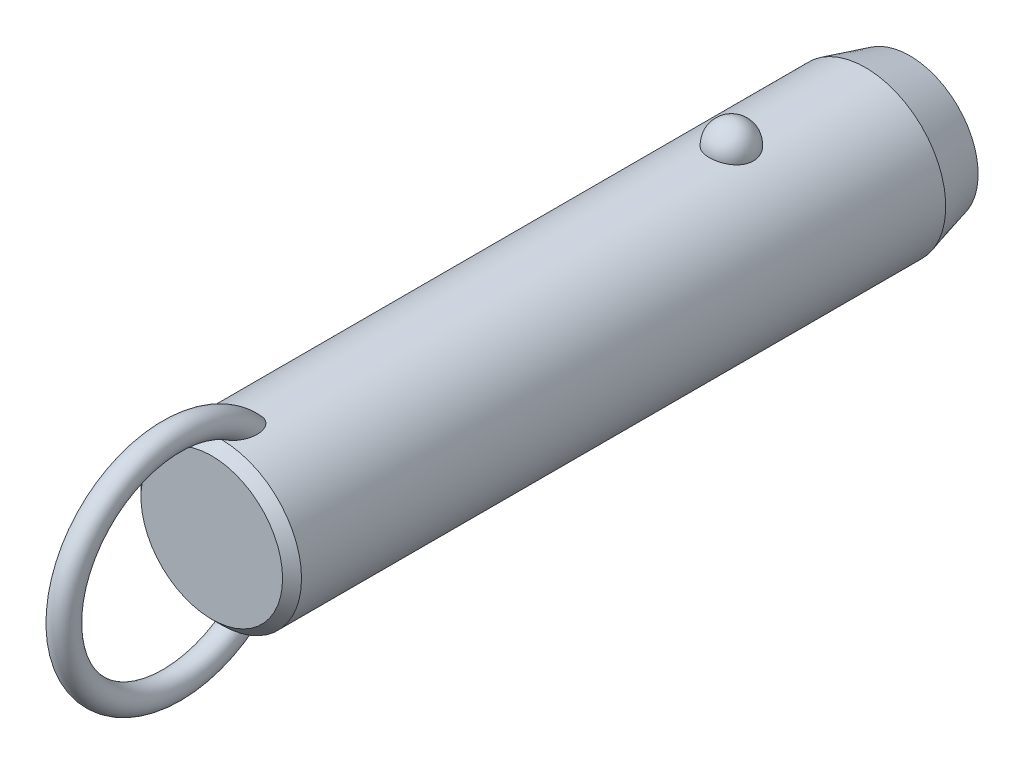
ISO-10303-21;
HEADER;
FILE_DESCRIPTION(('STEP AP214'),'2;1');
FILE_NAME('part.step','',(''),(''),'','','');
FILE_SCHEMA(('AUTOMOTIVE_DESIGN { 1 0 10303 214 1 1 1 1 }'));
ENDSEC;
DATA;
#1=APPLICATION_CONTEXT('core data for automotive mechanical design processes');
#2=APPLICATION_PROTOCOL_DEFINITION('international standard','automotive_design',2000,#1);
#3=PRODUCT_CONTEXT('',#1,'mechanical');
#4=PRODUCT('Part','Part','',(#3));
#5=PRODUCT_RELATED_PRODUCT_CATEGORY('part','',(#4));
#6=PRODUCT_DEFINITION_FORMATION('','',#4);
#7=PRODUCT_DEFINITION_CONTEXT('part definition',#1,'design');
#8=PRODUCT_DEFINITION('design','',#6,#7);
#9=PRODUCT_DEFINITION_SHAPE('','',#8);
#10=(LENGTH_UNIT() NAMED_UNIT(*) SI_UNIT(.MILLI.,.METRE.));
#11=(NAMED_UNIT(*) PLANE_ANGLE_UNIT() SI_UNIT($,.RADIAN.));
#12=(NAMED_UNIT(*) SI_UNIT($,.STERADIAN.) SOLID_ANGLE_UNIT());
#13=UNCERTAINTY_MEASURE_WITH_UNIT(LENGTH_MEASURE(1.E-05),#10,'distance_accuracy_value','');
#14=(GEOMETRIC_REPRESENTATION_CONTEXT(3) GLOBAL_UNCERTAINTY_ASSIGNED_CONTEXT((#13)) GLOBAL_UNIT_ASSIGNED_CONTEXT((#10,
#11,#12)) REPRESENTATION_CONTEXT('',''));
#15=CARTESIAN_POINT('',(0.,0.,0.));
#16=DIRECTION('',(0.,0.,1.));
#17=DIRECTION('',(1.,0.,0.));
#18=AXIS2_PLACEMENT_3D('',#15,#16,#17);
#19=CARTESIAN_POINT('',(0.,0.,66.));
#20=DIRECTION('',(0.,0.,-1.));
#21=DIRECTION('',(-1.,0.,0.));
#22=AXIS2_PLACEMENT_3D('',#19,#20,#21);
#23=CYLINDRICAL_SURFACE('',#22,12.7);
#24=CARTESIAN_POINT('',(3.46661256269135,12.2177165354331,-3.5));
#25=CARTESIAN_POINT('',(3.4666090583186,12.2177194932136,-3.30432790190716));
#26=CARTESIAN_POINT('',(3.45063567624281,12.2222841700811,-3.10861112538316));
#27=CARTESIAN_POINT('',(3.38712451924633,12.2400345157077,-2.72271899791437));
#28=CARTESIAN_POINT('',(3.33957415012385,12.2532236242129,-2.53254588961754));
#29=CARTESIAN_POINT('',(3.2141234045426,12.286724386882,-2.16324948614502));
#30=CARTESIAN_POINT('',(3.13623639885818,12.3070329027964,-1.98412136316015));
#31=CARTESIAN_POINT('',(2.95205930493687,12.3525018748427,-1.64180592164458));
#32=CARTESIAN_POINT('',(2.84577003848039,12.3776621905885,-1.47861814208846));
#33=CARTESIAN_POINT('',(2.60688050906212,12.4301712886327,-1.17190583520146));
#34=CARTESIAN_POINT('',(2.47415697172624,12.4575299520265,-1.02847897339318));
#35=CARTESIAN_POINT('',(2.18615174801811,12.5112810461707,-0.766177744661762));
#36=CARTESIAN_POINT('',(2.03087002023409,12.5376734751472,-0.64730342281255));
#37=CARTESIAN_POINT('',(1.70237334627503,12.5864761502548,-0.437732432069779));
#38=CARTESIAN_POINT('',(1.52920948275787,12.6088972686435,-0.346958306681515));
#39=CARTESIAN_POINT('',(1.16944170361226,12.6473352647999,-0.195750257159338));
#40=CARTESIAN_POINT('',(0.982839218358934,12.663352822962,-0.135313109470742));
#41=CARTESIAN_POINT('',(0.604961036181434,12.6869706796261,-0.0473241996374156));
#42=CARTESIAN_POINT('',(0.41382314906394,12.6947125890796,-0.0192185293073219));
#43=CARTESIAN_POINT('',(0.0293827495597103,12.7014203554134,0.0051725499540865));
#44=CARTESIAN_POINT('',(-0.163919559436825,12.7003870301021,0.00146092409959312));
#45=CARTESIAN_POINT('',(-0.544374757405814,12.689735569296,-0.0373939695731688));
#46=CARTESIAN_POINT('',(-0.731575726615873,12.6802364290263,-0.0721015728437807));
#47=CARTESIAN_POINT('',(-1.09733277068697,12.6538333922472,-0.171364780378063));
#48=CARTESIAN_POINT('',(-1.27588869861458,12.6369293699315,-0.235920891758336));
#49=CARTESIAN_POINT('',(-1.6204698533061,12.5973946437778,-0.393548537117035));
#50=CARTESIAN_POINT('',(-1.78641865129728,12.5747321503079,-0.486778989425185));
#51=CARTESIAN_POINT('',(-2.10030671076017,12.5261316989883,-0.699110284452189));
#52=CARTESIAN_POINT('',(-2.24824419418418,12.5001934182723,-0.818213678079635));
#53=CARTESIAN_POINT('',(-2.52491489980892,12.4472906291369,-1.08157124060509));
#54=CARTESIAN_POINT('',(-2.65324222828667,12.4203160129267,-1.22624992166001));
#55=CARTESIAN_POINT('',(-2.88410007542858,12.3687509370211,-1.53528325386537));
#56=CARTESIAN_POINT('',(-2.98662883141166,12.3441606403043,-1.69963924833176));
#57=CARTESIAN_POINT('',(-3.16432417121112,12.2998199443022,-2.04548497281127));
#58=CARTESIAN_POINT('',(-3.23917525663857,12.2801261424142,-2.22714424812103));
#59=CARTESIAN_POINT('',(-3.35800573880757,12.248167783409,-2.6009138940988));
#60=CARTESIAN_POINT('',(-3.4019860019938,12.2359030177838,-2.79302397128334));
#61=CARTESIAN_POINT('',(-3.45784812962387,12.2202347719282,-3.18140279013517));
#62=CARTESIAN_POINT('',(-3.46986123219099,12.2167950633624,-3.37765118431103));
#63=CARTESIAN_POINT('',(-3.46186273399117,12.2190638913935,-3.76943689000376));
#64=CARTESIAN_POINT('',(-3.44185196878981,12.2247721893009,-3.96497421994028));
#65=CARTESIAN_POINT('',(-3.37048652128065,12.2446381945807,-4.34881728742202));
#66=CARTESIAN_POINT('',(-3.31928253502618,12.2587552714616,-4.53715319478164));
#67=CARTESIAN_POINT('',(-3.18693461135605,12.2938237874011,-4.90231727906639));
#68=CARTESIAN_POINT('',(-3.1057895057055,12.3147754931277,-5.07914500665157));
#69=CARTESIAN_POINT('',(-2.91506431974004,12.3613125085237,-5.41732059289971));
#70=CARTESIAN_POINT('',(-2.80533587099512,12.3869217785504,-5.57858147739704));
#71=CARTESIAN_POINT('',(-2.560414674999,12.4398525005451,-5.88013283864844));
#72=CARTESIAN_POINT('',(-2.42522099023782,12.4671740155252,-6.02042254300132));
#73=CARTESIAN_POINT('',(-2.1323357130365,12.5205965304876,-6.27662798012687));
#74=CARTESIAN_POINT('',(-1.97456596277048,12.5466928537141,-6.3924554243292));
#75=CARTESIAN_POINT('',(-1.64115839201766,12.5946384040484,-6.59583547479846));
#76=CARTESIAN_POINT('',(-1.46552179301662,12.6164879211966,-6.68339001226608));
#77=CARTESIAN_POINT('',(-1.10356050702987,12.6532533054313,-6.82682153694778));
#78=CARTESIAN_POINT('',(-0.9173913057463,12.6682500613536,-6.8830698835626));
#79=CARTESIAN_POINT('',(-0.537836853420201,12.6900288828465,-6.96386887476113));
#80=CARTESIAN_POINT('',(-0.344452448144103,12.6968119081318,-6.9884232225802));
#81=CARTESIAN_POINT('',(0.0402577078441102,12.7013667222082,-7.00496469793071));
#82=CARTESIAN_POINT('',(0.231556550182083,12.6993008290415,-6.99753844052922));
#83=CARTESIAN_POINT('',(0.610105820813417,12.6867505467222,-6.9516636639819));
#84=CARTESIAN_POINT('',(0.797356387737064,12.6762664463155,-6.913216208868));
#85=CARTESIAN_POINT('',(1.16186657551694,12.6480587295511,-6.80658431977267));
#86=CARTESIAN_POINT('',(1.33915951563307,12.6303611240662,-6.73850666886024));
#87=CARTESIAN_POINT('',(1.67968518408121,12.5896027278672,-6.5745087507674));
#88=CARTESIAN_POINT('',(1.84291705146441,12.5665416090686,-6.47858678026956));
#89=CARTESIAN_POINT('',(2.15340192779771,12.5171072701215,-6.25982455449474));
#90=CARTESIAN_POINT('',(2.30037831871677,12.4906895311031,-6.13660186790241));
#91=CARTESIAN_POINT('',(2.5717412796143,12.4376567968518,-5.86739587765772));
#92=CARTESIAN_POINT('',(2.69612388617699,12.4110417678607,-5.72140858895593));
#93=CARTESIAN_POINT('',(2.92107785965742,12.360051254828,-5.40794137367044));
#94=CARTESIAN_POINT('',(3.02121329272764,12.3357209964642,-5.24014110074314));
#95=CARTESIAN_POINT('',(3.19236291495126,12.2925446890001,-4.88969865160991));
#96=CARTESIAN_POINT('',(3.26338839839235,12.2736965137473,-4.70706226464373));
#97=CARTESIAN_POINT('',(3.36788038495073,12.245404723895,-4.35469510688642));
#98=CARTESIAN_POINT('',(3.40484026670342,12.2351018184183,-4.18605935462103));
#99=CARTESIAN_POINT('',(3.45420764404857,12.2212564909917,-3.84496058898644));
#100=CARTESIAN_POINT('',(3.46661565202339,12.2177139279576,-3.67249765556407));
#101=CARTESIAN_POINT('',(3.46661256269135,12.2177165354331,-3.5));
#102=B_SPLINE_CURVE_WITH_KNOTS('',3,(#24,#25,#26,#27,#28,#29,#30,#31,#32,#33,#34,#35,#36,#37,
#38,#39,#40,#41,#42,#43,#44,#45,#46,#47,#48,#49,#50,#51,#52,#53,#54,#55,#56,#57,#58,#59,#60,#61,
#62,#63,#64,#65,#66,#67,#68,#69,#70,#71,#72,#73,#74,#75,#76,#77,#78,#79,#80,#81,#82,#83,#84,#85,
#86,#87,#88,#89,#90,#91,#92,#93,#94,#95,#96,#97,#98,#99,#100,#101),.UNSPECIFIED.,.T.,.F.,(4,2,2,
2,2,2,2,2,2,2,2,2,2,2,2,2,2,2,2,2,2,2,2,2,2,2,2,2,2,2,2,2,2,2,2,2,2,2,4),(0.,0.586396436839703,
1.17302689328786,1.7593990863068,2.34575431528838,2.93491084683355,3.52406845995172,
4.11158733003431,4.69904375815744,5.2762784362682,5.85345931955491,6.42265312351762,
6.99185659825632,7.56427334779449,8.136746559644,8.71981013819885,9.3029135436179,
9.89247258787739,10.4820150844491,11.0691335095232,11.6562366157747,12.2405256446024,
12.8248374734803,13.412244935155,13.9996740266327,14.5891883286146,15.1786623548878,
15.7609861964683,16.3432419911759,16.9148635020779,17.4864654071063,18.0560241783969,
18.6256177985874,19.2037609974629,19.7820055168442,20.3699810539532,20.957728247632,
21.4746855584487,21.9916320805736),.UNSPECIFIED.);
#103=CARTESIAN_POINT('',(3.46661256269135,12.2177165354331,-3.5));
#104=VERTEX_POINT('',#103);
#105=EDGE_CURVE('E41',#104,#104,#102,.T.);
#106=ORIENTED_EDGE('',*,*,#105,.T.);
#107=EDGE_LOOP('',(#106));
#108=FACE_BOUND('',#107,.T.);
#109=CARTESIAN_POINT('',(0.,0.,77.2));
#110=DIRECTION('',(0.,0.,1.));
#111=DIRECTION('',(1.,0.,0.));
#112=AXIS2_PLACEMENT_3D('',#109,#110,#111);
#113=CIRCLE('',#112,12.7);
#114=CARTESIAN_POINT('',(12.7,0.,77.2));
#115=VERTEX_POINT('',#114);
#116=EDGE_CURVE('E10',#115,#115,#113,.F.);
#117=ORIENTED_EDGE('',*,*,#116,.T.);
#118=EDGE_LOOP('',(#117));
#119=FACE_BOUND('',#118,.T.);
#120=CARTESIAN_POINT('',(-0.548122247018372,-12.6881662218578,70.9432187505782));
#121=CARTESIAN_POINT('',(-0.648865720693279,-12.6838128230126,70.977926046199));
#122=CARTESIAN_POINT('',(-0.746398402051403,-12.6783867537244,71.0220428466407));
#123=CARTESIAN_POINT('',(-0.93212506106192,-12.666091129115,71.1267647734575));
#124=CARTESIAN_POINT('',(-1.02030388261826,-12.6592192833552,71.187396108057));
#125=CARTESIAN_POINT('',(-1.18487740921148,-12.6448747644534,71.321847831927));
#126=CARTESIAN_POINT('',(-1.26134296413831,-12.637406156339,71.3955825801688));
#127=CARTESIAN_POINT('',(-1.4023120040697,-12.6225412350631,71.5536045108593));
#128=CARTESIAN_POINT('',(-1.46681470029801,-12.6151449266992,71.6378923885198));
#129=CARTESIAN_POINT('',(-1.60714786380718,-12.5981718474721,71.8496577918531));
#130=CARTESIAN_POINT('',(-1.67725126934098,-12.588900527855,71.980962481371));
#131=CARTESIAN_POINT('',(-1.79536591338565,-12.5725964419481,72.2532471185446));
#132=CARTESIAN_POINT('',(-1.84333535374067,-12.5655679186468,72.3942447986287));
#133=CARTESIAN_POINT('',(-1.93422576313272,-12.5519624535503,72.7376455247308));
#134=CARTESIAN_POINT('',(-1.96788773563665,-12.5466298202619,72.9425578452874));
#135=CARTESIAN_POINT('',(-1.9941399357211,-12.542463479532,73.2517600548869));
#136=CARTESIAN_POINT('',(-1.99883864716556,-12.5417153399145,73.3552987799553));
#137=CARTESIAN_POINT('',(-2.00078003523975,-12.5414074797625,73.5624512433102));
#138=CARTESIAN_POINT('',(-1.99802449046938,-12.5418474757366,73.6660649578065));
#139=CARTESIAN_POINT('',(-1.98336733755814,-12.5441750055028,73.9103207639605));
#140=CARTESIAN_POINT('',(-1.96851430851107,-12.5465291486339,74.0507804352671));
#141=CARTESIAN_POINT('',(-1.92707089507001,-12.5529612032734,74.3299607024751));
#142=CARTESIAN_POINT('',(-1.90047458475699,-12.5570399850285,74.4686803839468));
#143=CARTESIAN_POINT('',(-1.83619120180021,-12.5666008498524,74.7434113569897));
#144=CARTESIAN_POINT('',(-1.79850828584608,-12.57208240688,74.8794236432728));
#145=CARTESIAN_POINT('',(-1.71223796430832,-12.5841228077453,75.1478421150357));
#146=CARTESIAN_POINT('',(-1.66365679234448,-12.5906810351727,75.2802503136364));
#147=CARTESIAN_POINT('',(-1.5780450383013,-12.6016176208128,75.4854887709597));
#148=CARTESIAN_POINT('',(-1.54477252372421,-12.6057501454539,75.5599149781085));
#149=CARTESIAN_POINT('',(-1.47424480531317,-12.6141930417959,75.7068393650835));
#150=CARTESIAN_POINT('',(-1.43699041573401,-12.6185033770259,75.7793379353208));
#151=CARTESIAN_POINT('',(-1.35825795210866,-12.6272207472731,75.9218926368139));
#152=CARTESIAN_POINT('',(-1.31678520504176,-12.6316276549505,75.9919517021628));
#153=CARTESIAN_POINT('',(-1.22917793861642,-12.6404532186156,76.1290705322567));
#154=CARTESIAN_POINT('',(-1.18304514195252,-12.6448718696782,76.1961313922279));
#155=CARTESIAN_POINT('',(-1.07246411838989,-12.6547893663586,76.3438741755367));
#156=CARTESIAN_POINT('',(-1.00642239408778,-12.6602600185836,76.4233844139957));
#157=CARTESIAN_POINT('',(-0.864441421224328,-12.6707460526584,76.5731698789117));
#158=CARTESIAN_POINT('',(-0.78851691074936,-12.6757620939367,76.6434585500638));
#159=CARTESIAN_POINT('',(-0.652215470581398,-12.6833591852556,76.7486801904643));
#160=CARTESIAN_POINT('',(-0.594982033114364,-12.6861973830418,76.7876241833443));
#161=CARTESIAN_POINT('',(-0.475269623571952,-12.6912445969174,76.8564899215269));
#162=CARTESIAN_POINT('',(-0.412800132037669,-12.6934547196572,76.8864275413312));
#163=CARTESIAN_POINT('',(-0.295749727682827,-12.6966636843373,76.9297565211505));
#164=CARTESIAN_POINT('',(-0.241949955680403,-12.6978134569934,76.9452188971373));
#165=CARTESIAN_POINT('',(-0.132508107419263,-12.6994261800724,76.9668845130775));
#166=CARTESIAN_POINT('',(-0.0768679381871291,-12.6998898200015,76.9730970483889));
#167=CARTESIAN_POINT('',(0.0347696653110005,-12.7000752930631,76.9755838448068));
#168=CARTESIAN_POINT('',(0.0907676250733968,-12.6997954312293,76.9718353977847));
#169=CARTESIAN_POINT('',(0.20128301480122,-12.6985255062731,76.9547883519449));
#170=CARTESIAN_POINT('',(0.255799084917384,-12.6975348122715,76.9414812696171));
#171=CARTESIAN_POINT('',(0.376042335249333,-12.6946091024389,76.9020379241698));
#172=CARTESIAN_POINT('',(0.44095085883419,-12.6924943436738,76.8734492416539));
#173=CARTESIAN_POINT('',(0.565350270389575,-12.6875639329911,76.8063234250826));
#174=CARTESIAN_POINT('',(0.624828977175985,-12.6847467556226,76.7677646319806));
#175=CARTESIAN_POINT('',(0.774116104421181,-12.6767252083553,76.656949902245));
#176=CARTESIAN_POINT('',(0.859449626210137,-12.6711344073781,76.5787605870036));
#177=CARTESIAN_POINT('',(1.01789440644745,-12.6593922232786,76.410943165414));
#178=CARTESIAN_POINT('',(1.09096902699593,-12.653239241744,76.321282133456));
#179=CARTESIAN_POINT('',(1.22268793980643,-12.6411674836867,76.1402658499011));
#180=CARTESIAN_POINT('',(1.28193986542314,-12.6352572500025,76.049345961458));
#181=CARTESIAN_POINT('',(1.39259777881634,-12.6235401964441,75.8627929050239));
#182=CARTESIAN_POINT('',(1.44399707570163,-12.6177334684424,75.7671558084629));
#183=CARTESIAN_POINT('',(1.53972870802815,-12.6064093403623,75.5722738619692));
#184=CARTESIAN_POINT('',(1.58405262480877,-12.6008922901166,75.4730248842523));
#185=CARTESIAN_POINT('',(1.66600705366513,-12.5903187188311,75.2717727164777));
#186=CARTESIAN_POINT('',(1.70363651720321,-12.5852622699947,75.1697690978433));
#187=CARTESIAN_POINT('',(1.77545379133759,-12.5753406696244,74.9543580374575));
#188=CARTESIAN_POINT('',(1.80903453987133,-12.5705328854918,74.840745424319));
#189=CARTESIAN_POINT('',(1.86844163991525,-12.5618400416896,74.6114575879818));
#190=CARTESIAN_POINT('',(1.89426665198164,-12.5579551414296,74.4957820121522));
#191=CARTESIAN_POINT('',(1.9378546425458,-12.5513030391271,74.2630072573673));
#192=CARTESIAN_POINT('',(1.9556264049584,-12.5485346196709,74.1459097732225));
#193=CARTESIAN_POINT('',(1.98264463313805,-12.5442934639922,73.9107473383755));
#194=CARTESIAN_POINT('',(1.99189298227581,-12.5428204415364,73.7926826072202));
#195=CARTESIAN_POINT('',(2.00416068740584,-12.540871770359,73.4806225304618));
#196=CARTESIAN_POINT('',(1.99944433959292,-12.541631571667,73.2862290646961));
#197=CARTESIAN_POINT('',(1.96113755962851,-12.5476846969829,72.9003095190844));
#198=CARTESIAN_POINT('',(1.92758341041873,-12.5529723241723,72.7087801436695));
#199=CARTESIAN_POINT('',(1.83934342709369,-12.5661532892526,72.3822728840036));
#200=CARTESIAN_POINT('',(1.79215440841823,-12.5730485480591,72.2452499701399));
#201=CARTESIAN_POINT('',(1.67676242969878,-12.588958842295,71.9804459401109));
#202=CARTESIAN_POINT('',(1.60859050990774,-12.597970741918,71.8526515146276));
#203=CARTESIAN_POINT('',(1.46583832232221,-12.6152829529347,71.6358006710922));
#204=CARTESIAN_POINT('',(1.39525727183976,-12.6233659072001,71.5441050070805));
#205=CARTESIAN_POINT('',(1.23992594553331,-12.6395676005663,71.3734854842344));
#206=CARTESIAN_POINT('',(1.1551793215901,-12.6476863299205,71.2945583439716));
#207=CARTESIAN_POINT('',(0.971995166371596,-12.6630846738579,71.1526438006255));
#208=CARTESIAN_POINT('',(0.873456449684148,-12.6703572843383,71.0897849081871));
#209=CARTESIAN_POINT('',(0.665847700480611,-12.6829569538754,70.9844870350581));
#210=CARTESIAN_POINT('',(0.556784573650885,-12.688285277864,70.9420347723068));
#211=CARTESIAN_POINT('',(0.347338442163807,-12.6956226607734,70.8844434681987));
#212=CARTESIAN_POINT('',(0.247759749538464,-12.6979816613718,70.8663996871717));
#213=CARTESIAN_POINT('',(0.0470218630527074,-12.7003077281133,70.848600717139));
#214=CARTESIAN_POINT('',(-0.0541350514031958,-12.7002779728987,70.8488212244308));
#215=CARTESIAN_POINT('',(-0.221414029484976,-12.6982482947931,70.8643639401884));
#216=CARTESIAN_POINT('',(-0.288055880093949,-12.6969033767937,70.8746662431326));
#217=CARTESIAN_POINT('',(-0.419599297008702,-12.6932369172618,70.9031348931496));
#218=CARTESIAN_POINT('',(-0.484501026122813,-12.6909154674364,70.9213005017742));
#219=CARTESIAN_POINT('',(-0.548122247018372,-12.6881662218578,70.9432187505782));
#220=B_SPLINE_CURVE_WITH_KNOTS('',3,(#120,#121,#122,#123,#124,#125,#126,#127,#128,#129,#130,
#131,#132,#133,#134,#135,#136,#137,#138,#139,#140,#141,#142,#143,#144,#145,#146,#147,#148,#149,
#150,#151,#152,#153,#154,#155,#156,#157,#158,#159,#160,#161,#162,#163,#164,#165,#166,#167,#168,
#169,#170,#171,#172,#173,#174,#175,#176,#177,#178,#179,#180,#181,#182,#183,#184,#185,#186,#187,
#188,#189,#190,#191,#192,#193,#194,#195,#196,#197,#198,#199,#200,#201,#202,#203,#204,#205,#206,
#207,#208,#209,#210,#211,#212,#213,#214,#215,#216,#217,#218,#219),.UNSPECIFIED.,.T.,.F.,(4,2,2,
2,2,2,2,2,2,2,2,2,2,2,2,2,2,2,2,2,2,2,2,2,2,2,2,2,2,2,2,2,2,2,2,2,2,2,2,2,2,2,2,2,2,2,2,2,2,4),
(0.,0.31964225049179,0.639794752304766,0.957927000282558,1.27608021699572,1.72100165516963,
2.16675988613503,2.78630021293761,3.0970578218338,3.40774128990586,3.83096358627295,
4.2543996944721,4.67767724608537,5.10071330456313,5.34550297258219,5.59024267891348,
5.83467707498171,6.07902143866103,6.38891080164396,6.69834321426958,6.90560910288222,
7.11250749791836,7.27977315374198,7.44687060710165,7.61434932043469,7.78197685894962,
7.99365544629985,8.20579780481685,8.55147335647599,8.89816429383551,9.22375138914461,
9.5496143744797,9.87586224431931,10.202161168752,10.557587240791,10.9130746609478,
11.2681734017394,11.6231936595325,12.2046601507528,12.7853961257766,13.219164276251,
13.6522938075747,13.9989174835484,14.3454519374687,14.6946768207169,15.0436740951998,
15.3457513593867,15.6474266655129,15.8493051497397,16.0511646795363),.UNSPECIFIED.);
#221=CARTESIAN_POINT('',(-0.548122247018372,-12.6881662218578,70.9432187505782));
#222=VERTEX_POINT('',#221);
#223=EDGE_CURVE('E60',#222,#222,#220,.T.);
#224=ORIENTED_EDGE('',*,*,#223,.T.);
#225=EDGE_LOOP('',(#224));
#226=FACE_BOUND('',#225,.T.);
#227=CARTESIAN_POINT('',(-0.548122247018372,12.6881662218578,70.9432187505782));
#228=CARTESIAN_POINT('',(-0.459436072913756,12.6919968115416,70.912673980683));
#229=CARTESIAN_POINT('',(-0.368189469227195,12.6949996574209,70.8893913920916));
#230=CARTESIAN_POINT('',(-0.183024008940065,12.6990186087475,70.8584062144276));
#231=CARTESIAN_POINT('',(-0.0891049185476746,12.7000345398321,70.8507049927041));
#232=CARTESIAN_POINT('',(0.0987147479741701,12.6999636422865,70.8512455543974));
#233=CARTESIAN_POINT('',(0.192615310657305,12.6988761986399,70.8594920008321));
#234=CARTESIAN_POINT('',(0.377658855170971,12.6947211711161,70.8915515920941));
#235=CARTESIAN_POINT('',(0.468801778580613,12.6916535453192,70.9153650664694));
#236=CARTESIAN_POINT('',(0.645809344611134,12.6838788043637,70.9774565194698));
#237=CARTESIAN_POINT('',(0.731679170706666,12.6791733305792,71.015720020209));
#238=CARTESIAN_POINT('',(0.896315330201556,12.6686004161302,71.1051204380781));
#239=CARTESIAN_POINT('',(0.975080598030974,12.6627328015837,71.1562592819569));
#240=CARTESIAN_POINT('',(1.12963655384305,12.6499161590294,71.2736782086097));
#241=CARTESIAN_POINT('',(1.20478673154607,12.6429194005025,71.3407929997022));
#242=CARTESIAN_POINT('',(1.34448241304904,12.6288282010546,71.4852250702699));
#243=CARTESIAN_POINT('',(1.40902173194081,12.621733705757,71.5625482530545));
#244=CARTESIAN_POINT('',(1.55208211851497,12.6050877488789,71.7592475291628));
#245=CARTESIAN_POINT('',(1.62510490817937,12.5957546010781,71.8826540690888));
#246=CARTESIAN_POINT('',(1.7501904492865,12.5789823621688,72.1397690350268));
#247=CARTESIAN_POINT('',(1.80221377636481,12.5715468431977,72.273496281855));
#248=CARTESIAN_POINT('',(1.90309965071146,12.5567434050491,72.5983516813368));
#249=CARTESIAN_POINT('',(1.94342317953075,12.5504515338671,72.7921611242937));
#250=CARTESIAN_POINT('',(1.99332997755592,12.5426147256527,73.1837881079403));
#251=CARTESIAN_POINT('',(2.00285305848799,12.5410790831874,73.3816127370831));
#252=CARTESIAN_POINT('',(1.99678999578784,12.5420407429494,73.7166427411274));
#253=CARTESIAN_POINT('',(1.98794117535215,12.5434564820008,73.8540428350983));
#254=CARTESIAN_POINT('',(1.95865119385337,12.5480641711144,74.1276394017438));
#255=CARTESIAN_POINT('',(1.93820436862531,12.5512569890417,74.2638352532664));
#256=CARTESIAN_POINT('',(1.88647896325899,12.5591352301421,74.5342493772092));
#257=CARTESIAN_POINT('',(1.85518800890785,12.5638223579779,74.6684652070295));
#258=CARTESIAN_POINT('',(1.78217886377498,12.5743868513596,74.9339362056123));
#259=CARTESIAN_POINT('',(1.74046509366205,12.5802637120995,75.0651926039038));
#260=CARTESIAN_POINT('',(1.66024095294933,12.5910571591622,75.2860855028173));
#261=CARTESIAN_POINT('',(1.62434772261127,12.5957535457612,75.3766904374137));
#262=CARTESIAN_POINT('',(1.5470900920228,12.6054762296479,75.5555125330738));
#263=CARTESIAN_POINT('',(1.50572681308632,12.6105024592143,75.6437301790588));
#264=CARTESIAN_POINT('',(1.41728020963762,12.620748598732,75.8169321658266));
#265=CARTESIAN_POINT('',(1.37021377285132,12.625967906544,75.9019251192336));
#266=CARTESIAN_POINT('',(1.2696962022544,12.6364721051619,76.0680072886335));
#267=CARTESIAN_POINT('',(1.21624929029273,12.6417569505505,76.1490990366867));
#268=CARTESIAN_POINT('',(1.10304413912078,12.6521331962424,76.3047027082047));
#269=CARTESIAN_POINT('',(1.04340936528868,12.657226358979,76.3793033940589));
#270=CARTESIAN_POINT('',(0.91591933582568,12.6670906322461,76.521324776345));
#271=CARTESIAN_POINT('',(0.84806456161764,12.6718617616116,76.5887458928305));
#272=CARTESIAN_POINT('',(0.717035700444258,12.67987711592,76.7006247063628));
#273=CARTESIAN_POINT('',(0.655526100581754,12.6832377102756,76.7469970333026));
#274=CARTESIAN_POINT('',(0.525985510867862,12.6892676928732,76.8296195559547));
#275=CARTESIAN_POINT('',(0.45796984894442,12.6919386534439,76.8658927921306));
#276=CARTESIAN_POINT('',(0.334859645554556,12.695691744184,76.9166572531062));
#277=CARTESIAN_POINT('',(0.281116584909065,12.6970073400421,76.9343733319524));
#278=CARTESIAN_POINT('',(0.171425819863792,12.6989609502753,76.9606429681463));
#279=CARTESIAN_POINT('',(0.11548082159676,12.699599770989,76.9692074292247));
#280=CARTESIAN_POINT('',(0.00272618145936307,12.7001251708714,76.9762531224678));
#281=CARTESIAN_POINT('',(-0.0540859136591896,12.7000089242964,76.9746964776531));
#282=CARTESIAN_POINT('',(-0.166544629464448,12.6990328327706,76.9616005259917));
#283=CARTESIAN_POINT('',(-0.222190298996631,12.6981724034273,76.9500533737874));
#284=CARTESIAN_POINT('',(-0.342018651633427,12.695562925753,76.9149128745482));
#285=CARTESIAN_POINT('',(-0.405606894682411,12.6936676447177,76.8893322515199));
#286=CARTESIAN_POINT('',(-0.527815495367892,12.6891754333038,76.8283111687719));
#287=CARTESIAN_POINT('',(-0.586425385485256,12.6865770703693,76.7928505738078));
#288=CARTESIAN_POINT('',(-0.731842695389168,12.6792129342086,76.6914960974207));
#289=CARTESIAN_POINT('',(-0.814709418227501,12.6740767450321,76.6200395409));
#290=CARTESIAN_POINT('',(-0.969101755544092,12.6632083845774,76.4658900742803));
#291=CARTESIAN_POINT('',(-1.04059564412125,12.6574746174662,76.3831668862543));
#292=CARTESIAN_POINT('',(-1.16981116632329,12.6461638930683,76.2158096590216));
#293=CARTESIAN_POINT('',(-1.22811369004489,12.6405994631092,76.1316166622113));
#294=CARTESIAN_POINT('',(-1.33743405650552,12.6295007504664,75.9585791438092));
#295=CARTESIAN_POINT('',(-1.38844577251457,12.6239664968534,75.8697307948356));
#296=CARTESIAN_POINT('',(-1.48400702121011,12.6130898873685,75.688389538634));
#297=CARTESIAN_POINT('',(-1.52854232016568,12.6077479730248,75.5958891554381));
#298=CARTESIAN_POINT('',(-1.6115011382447,12.5974127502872,75.4081607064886));
#299=CARTESIAN_POINT('',(-1.64992317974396,12.5924195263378,75.3129319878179));
#300=CARTESIAN_POINT('',(-1.73468589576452,12.581070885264,75.0828936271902));
#301=CARTESIAN_POINT('',(-1.77831261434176,12.5749388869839,74.9470661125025));
#302=CARTESIAN_POINT('',(-1.85439734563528,12.5639437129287,74.6722128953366));
#303=CARTESIAN_POINT('',(-1.88684994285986,12.5590811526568,74.5331856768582));
#304=CARTESIAN_POINT('',(-1.94008483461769,12.550968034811,74.2530923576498));
#305=CARTESIAN_POINT('',(-1.96088706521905,12.5477147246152,74.1120301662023));
#306=CARTESIAN_POINT('',(-1.99000539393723,12.5431291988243,73.8286689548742));
#307=CARTESIAN_POINT('',(-1.99832911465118,12.5417958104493,73.6863707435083));
#308=CARTESIAN_POINT('',(-2.00166624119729,12.5412674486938,73.3576271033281));
#309=CARTESIAN_POINT('',(-1.99178843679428,12.5428579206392,73.171088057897));
#310=CARTESIAN_POINT('',(-1.9445518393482,12.5502731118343,72.8016240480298));
#311=CARTESIAN_POINT('',(-1.90724032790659,12.5560905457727,72.6186934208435));
#312=CARTESIAN_POINT('',(-1.81330718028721,12.5699462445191,72.3048488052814));
#313=CARTESIAN_POINT('',(-1.76338820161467,12.5771273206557,72.1719105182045));
#314=CARTESIAN_POINT('',(-1.64305018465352,12.593414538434,71.9156813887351));
#315=CARTESIAN_POINT('',(-1.57265346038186,12.6025185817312,71.792380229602));
#316=CARTESIAN_POINT('',(-1.42634956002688,12.6198178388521,71.5835648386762));
#317=CARTESIAN_POINT('',(-1.35423772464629,12.6278405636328,71.4953846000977));
#318=CARTESIAN_POINT('',(-1.19645664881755,12.6437632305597,71.332107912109));
#319=CARTESIAN_POINT('',(-1.11080536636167,12.6516633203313,71.2569944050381));
#320=CARTESIAN_POINT('',(-0.947219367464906,12.6648319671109,71.1378114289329));
#321=CARTESIAN_POINT('',(-0.871624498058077,12.670300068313,71.0905414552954));
#322=CARTESIAN_POINT('',(-0.714161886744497,12.6801492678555,71.0077413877));
#323=CARTESIAN_POINT('',(-0.632295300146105,12.684530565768,70.9722091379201));
#324=CARTESIAN_POINT('',(-0.548122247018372,12.6881662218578,70.9432187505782));
#325=B_SPLINE_CURVE_WITH_KNOTS('',3,(#227,#228,#229,#230,#231,#232,#233,#234,#235,#236,#237,
#238,#239,#240,#241,#242,#243,#244,#245,#246,#247,#248,#249,#250,#251,#252,#253,#254,#255,#256,
#257,#258,#259,#260,#261,#262,#263,#264,#265,#266,#267,#268,#269,#270,#271,#272,#273,#274,#275,
#276,#277,#278,#279,#280,#281,#282,#283,#284,#285,#286,#287,#288,#289,#290,#291,#292,#293,#294,
#295,#296,#297,#298,#299,#300,#301,#302,#303,#304,#305,#306,#307,#308,#309,#310,#311,#312,#313,
#314,#315,#316,#317,#318,#319,#320,#321,#322,#323,#324),.UNSPECIFIED.,.T.,.F.,(4,2,2,2,2,2,2,2,
2,2,2,2,2,2,2,2,2,2,2,2,2,2,2,2,2,2,2,2,2,2,2,2,2,2,2,2,2,2,2,2,2,2,2,2,2,2,2,2,4),(0.,
0.281328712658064,0.562682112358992,0.844117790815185,1.12555942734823,1.40671982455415,
1.68792232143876,1.98972294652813,2.29169886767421,2.72039860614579,3.14989948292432,
3.74084916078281,4.33295293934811,4.74554109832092,5.15833092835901,5.57159335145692,
5.98468079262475,6.2772277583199,6.56971484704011,6.86135609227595,7.15280542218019,
7.43927407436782,7.72572595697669,7.95635862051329,8.18646071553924,8.35559393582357,
8.52452541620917,8.69408946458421,8.86378678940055,9.06834348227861,9.27332014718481,
9.60010414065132,9.92778432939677,10.2350252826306,10.5425229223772,10.8506864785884,
11.1589244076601,11.5867893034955,12.0148612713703,12.4421984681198,12.8692745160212,
13.4279365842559,13.9856380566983,14.4107062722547,14.8353130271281,15.1765567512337,
15.5173516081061,15.7844129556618,16.051425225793),.UNSPECIFIED.);
#326=CARTESIAN_POINT('',(-0.548122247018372,12.6881662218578,70.9432187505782));
#327=VERTEX_POINT('',#326);
#328=EDGE_CURVE('E68',#327,#327,#325,.T.);
#329=ORIENTED_EDGE('',*,*,#328,.T.);
#330=EDGE_LOOP('',(#329));
#331=FACE_BOUND('',#330,.T.);
#332=CARTESIAN_POINT('',(0.,0.,-24.6999999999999));
#333=DIRECTION('',(0.,0.,-1.));
#334=DIRECTION('',(-1.,0.,0.));
#335=AXIS2_PLACEMENT_3D('',#332,#333,#334);
#336=CIRCLE('',#335,12.7);
#337=CARTESIAN_POINT('',(-12.7,0.,-24.6999999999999));
#338=VERTEX_POINT('',#337);
#339=EDGE_CURVE('E57',#338,#338,#336,.F.);
#340=ORIENTED_EDGE('',*,*,#339,.T.);
#341=EDGE_LOOP('',(#340));
#342=FACE_BOUND('',#341,.T.);
#343=ADVANCED_FACE('F37',(#108,#119,#226,#331,#342),#23,.T.);
#344=CARTESIAN_POINT('',(0.,0.,-31.7));
#345=DIRECTION('',(0.,0.,-1.));
#346=DIRECTION('',(-1.,0.,0.));
#347=AXIS2_PLACEMENT_3D('',#344,#345,#346);
#348=PLANE('',#347);
#349=CARTESIAN_POINT('',(0.,0.,-31.7));
#350=DIRECTION('',(0.,0.,-1.));
#351=DIRECTION('',(-1.,0.,0.));
#352=AXIS2_PLACEMENT_3D('',#349,#350,#351);
#353=CIRCLE('',#352,10.8243556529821);
#354=CARTESIAN_POINT('',(-10.8243556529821,0.,-31.7));
#355=VERTEX_POINT('',#354);
#356=EDGE_CURVE('E67',#355,#355,#353,.T.);
#357=ORIENTED_EDGE('',*,*,#356,.T.);
#358=EDGE_LOOP('',(#357));
#359=FACE_BOUND('',#358,.T.);
#360=ADVANCED_FACE('F86',(#359),#348,.T.);
#361=CARTESIAN_POINT('',(0.,0.,-31.7));
#362=DIRECTION('',(0.,0.,1.));
#363=DIRECTION('',(1.,0.,0.));
#364=AXIS2_PLACEMENT_3D('',#361,#362,#363);
#365=CONICAL_SURFACE('',#364,10.8243556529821,0.261799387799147);
#366=ORIENTED_EDGE('',*,*,#339,.F.);
#367=EDGE_LOOP('',(#366));
#368=FACE_BOUND('',#367,.T.);
#369=ORIENTED_EDGE('',*,*,#356,.F.);
#370=EDGE_LOOP('',(#369));
#371=FACE_BOUND('',#370,.T.);
#372=ADVANCED_FACE('F84',(#368,#371),#365,.T.);
#373=CARTESIAN_POINT('',(0.,0.,78.7));
#374=DIRECTION('',(0.,0.,1.));
#375=DIRECTION('',(1.,0.,0.));
#376=AXIS2_PLACEMENT_3D('',#373,#374,#375);
#377=PLANE('',#376);
#378=CARTESIAN_POINT('',(0.,0.,78.7));
#379=DIRECTION('',(0.,0.,1.));
#380=DIRECTION('',(1.,0.,0.));
#381=AXIS2_PLACEMENT_3D('',#378,#379,#380);
#382=CIRCLE('',#381,11.2);
#383=CARTESIAN_POINT('',(11.2,0.,78.7));
#384=VERTEX_POINT('',#383);
#385=EDGE_CURVE('E50',#384,#384,#382,.T.);
#386=ORIENTED_EDGE('',*,*,#385,.T.);
#387=EDGE_LOOP('',(#386));
#388=FACE_BOUND('',#387,.T.);
#389=ADVANCED_FACE('F78',(#388),#377,.T.);
#390=CARTESIAN_POINT('',(0.,0.,85.05));
#391=DIRECTION('',(1.,0.,0.));
#392=DIRECTION('',(0.,0.,-1.));
#393=AXIS2_PLACEMENT_3D('',#390,#391,#392);
#394=TOROIDAL_SURFACE('',#393,17.05,2.);
#395=ORIENTED_EDGE('',*,*,#328,.F.);
#396=EDGE_LOOP('',(#395));
#397=FACE_BOUND('',#396,.T.);
#398=ORIENTED_EDGE('',*,*,#223,.F.);
#399=EDGE_LOOP('',(#398));
#400=FACE_BOUND('',#399,.T.);
#401=ADVANCED_FACE('F74',(#397,#400),#394,.T.);
#402=CARTESIAN_POINT('',(0.,0.,78.7));
#403=DIRECTION('',(0.,0.,-1.));
#404=DIRECTION('',(-1.,0.,0.));
#405=AXIS2_PLACEMENT_3D('',#402,#403,#404);
#406=CONICAL_SURFACE('',#405,11.2,0.785398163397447);
#407=ORIENTED_EDGE('',*,*,#116,.F.);
#408=EDGE_LOOP('',(#407));
#409=FACE_BOUND('',#408,.T.);
#410=ORIENTED_EDGE('',*,*,#385,.F.);
#411=EDGE_LOOP('',(#410));
#412=FACE_BOUND('',#411,.T.);
#413=ADVANCED_FACE('F39',(#409,#412),#406,.T.);
#414=CARTESIAN_POINT('',(0.,12.7,-3.5));
#415=DIRECTION('',(0.,1.,0.));
#416=DIRECTION('',(0.,0.,-1.));
#417=AXIS2_PLACEMENT_3D('',#414,#415,#416);
#418=SPHERICAL_SURFACE('',#417,3.5);
#419=ORIENTED_EDGE('',*,*,#105,.F.);
#420=EDGE_LOOP('',(#419));
#421=FACE_BOUND('',#420,.T.);
#422=ADVANCED_FACE('F80',(#421),#418,.T.);
#423=CLOSED_SHELL('',(#343,#360,#372,#389,#401,#413,#422));
#424=MANIFOLD_SOLID_BREP('B2',#423);
#425=ADVANCED_BREP_SHAPE_REPRESENTATION('',(#18,#424),#14);
#426=SHAPE_DEFINITION_REPRESENTATION(#9,#425);
ENDSEC;
END-ISO-10303-21;
